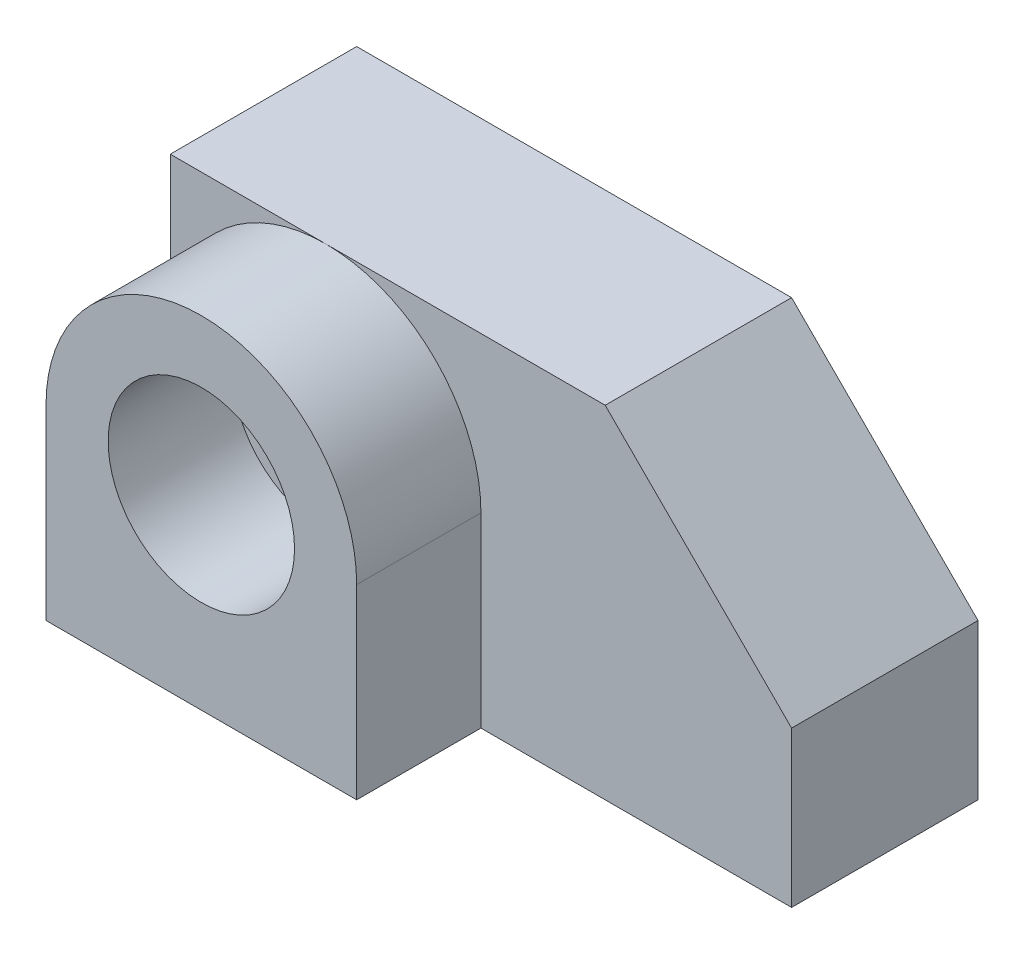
from build123d import *

# Parameters (mm, degrees)
SKETCH_1_W      = 100
SKETCH_1_H      = 55
EXTRUDE_1_DEPTH = 30
CHAMFER_1_SIZE  = 30
SKETCH_2_R      = 15
EXTRUDE_2_DEPTH = 20


with BuildPart() as part:
    # Sketch 1 → Extrude 1 (new body)
    with BuildSketch(Plane.XY):
        with Locations((0, 27.5)):
            Rectangle(SKETCH_1_W, SKETCH_1_H)
    extrude(amount=-EXTRUDE_1_DEPTH)

    # Chamfer 1
    chamfer_1_edges = [part.edges().sort_by_distance(p)[0] for p in [
        (50, 55, -15),
    ]]
    chamfer(chamfer_1_edges, length=CHAMFER_1_SIZE)

    # Sketch 2 → Extrude 2 (add)
    with BuildSketch(Plane.XY):
        with BuildLine():
            Line((-50, 30), (-50, 0))
            Line((-50, 0), (0, 0))
            Line((0, 0), (0, 30))
            ThreePointArc((0, 30), (-25, 55), (-50, 30))
        make_face()
        with Locations((-25, 30)):
            Circle(SKETCH_2_R, mode=Mode.SUBTRACT)
    extrude(amount=EXTRUDE_2_DEPTH)


solid = part.part
